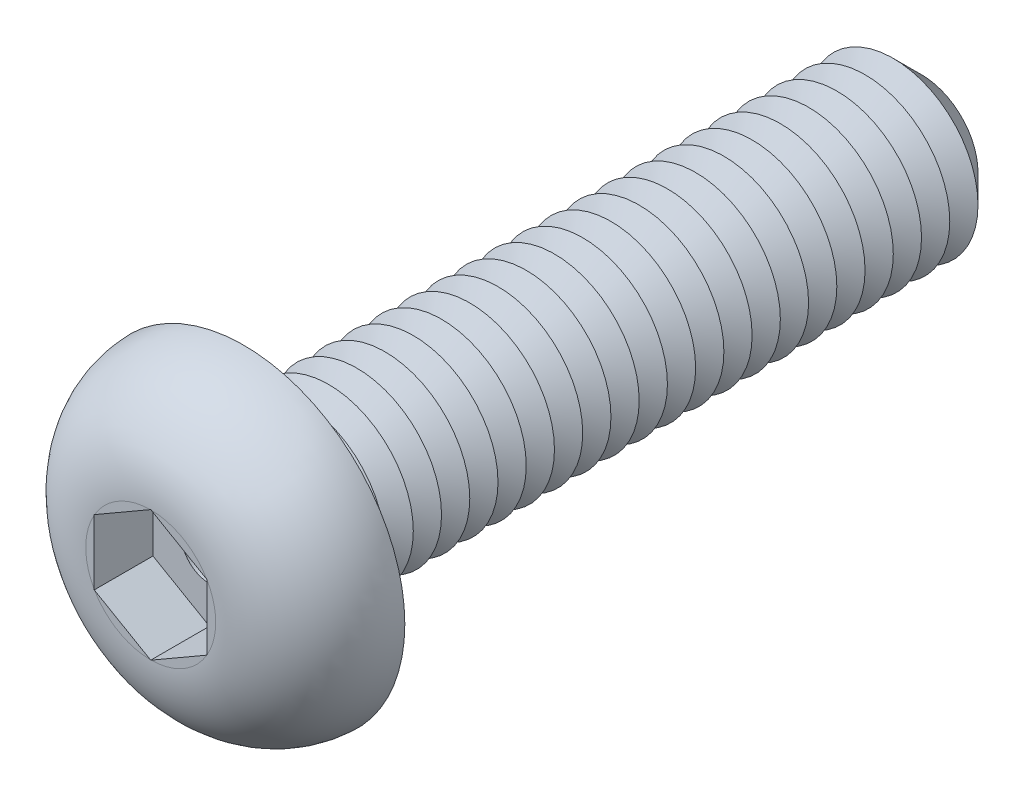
from build123d import *

# Parameters (mm, degrees)
CUT_EXTRUDE1_DEPTH  = 1.04
SKETCH4_R           = 1.5
BOSS_EXTRUDE1_DEPTH = 12
CHAMFER1_SIZE       = 0.5
LPATTERN1_COUNT     = 22
LPATTERN1_PITCH     = 0.5
FILLET2_R           = 0.25
SKETCH6_R           = 0.5
CUT_EXTRUDE2_DEPTH  = 12.61


with BuildPart() as part:
    # Sketch2 → Revolve1 (revolve)
    with BuildSketch(Plane(origin=(0, 0, 0), x_dir=(0, 0, -1), z_dir=(1, 0, 0)), mode=Mode.PRIVATE) as revolve1_sk:
        with BuildLine():
            Line((0, 0), (-1.65, 0))
            Line((-1.65, 0), (-1.65, 1.150735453))
            ThreePointArc((-1.65, 1.150735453), (-1.169631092, 2.335007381), (0, 2.85))
            Line((0, 2.85), (0, 0))
        make_face()
    revolve(revolve1_sk.sketch.rotate(Axis((0, 0, 47.934239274), (0, 0, -1)), 90), axis=Axis((0, 0, 47.934239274), (0, 0, -1)))

    # Sketch3 → Cut-Extrude1 (cut)
    with BuildSketch(Plane.XY.offset(1.65)):
        Polygon((0, 1.154700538), (-1, 0.577350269), (-1, -0.577350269), (0, -1.154700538), (1, -0.577350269), (1, 0.577350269), align=None)
    extrude(amount=-CUT_EXTRUDE1_DEPTH, mode=Mode.SUBTRACT)


with BuildPart() as cut_extrude1_kept_piece:
    # of the separate pieces the step leaves, the one the design keeps (cut_extrude1_pieces_kept)
    add(part.part.solids().sort_by_distance((2.85, 0, 0))[0])

    # Sketch4 → Boss-Extrude1 (add)
    with BuildSketch(Plane(origin=(0, 0, 0), x_dir=(-1, 0, 0), z_dir=(0, 0, -1))):
        with Locations(Location((0, 0, 0), (0, 0, 180))):
            Circle(SKETCH4_R)
    extrude(amount=BOSS_EXTRUDE1_DEPTH)

    # Chamfer1
    chamfer1_edges = [cut_extrude1_kept_piece.edges().sort_by_distance(p)[0] for p in [
        (-1.5, 0, -12),
    ]]
    chamfer(chamfer1_edges, length=CHAMFER1_SIZE)

    # Sketch5 → Cut-Revolve1 (revolve, cut)
    with BuildSketch(Plane(origin=(0, 0, 0), x_dir=(0, 0, -1), z_dir=(1, 0, 0)), mode=Mode.PRIVATE) as cut_revolve1_sk:
        Polygon((0.5, 1.5), (1, 1.5), (0.75, 1.066987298), align=None)
    cut_revolve1 = revolve(cut_revolve1_sk.sketch.rotate(Axis((0, 0, 47.934239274), (0, 0, -1)), 90), axis=Axis((0, 0, 47.934239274), (0, 0, -1)), mode=Mode.SUBTRACT)

    # LPattern1: Cut-Revolve1 ×22
    with Locations(*[(0, 0, -i * LPATTERN1_PITCH) for i in range(1, LPATTERN1_COUNT)]):
        add(cut_revolve1, mode=Mode.SUBTRACT)

    # Fillet2
    fillet2_edges = [cut_extrude1_kept_piece.edges().sort_by_distance(p)[0] for p in [
        (-1.5, 0, 0),
    ]]
    fillet(fillet2_edges, radius=FILLET2_R)

    # Sketch6 → Cut-Extrude2 (cut)
    with BuildSketch(Plane.XY.offset(0.61)):
        Circle(SKETCH6_R)
    extrude(amount=-CUT_EXTRUDE2_DEPTH, mode=Mode.SUBTRACT)


solid = cut_extrude1_kept_piece.part
